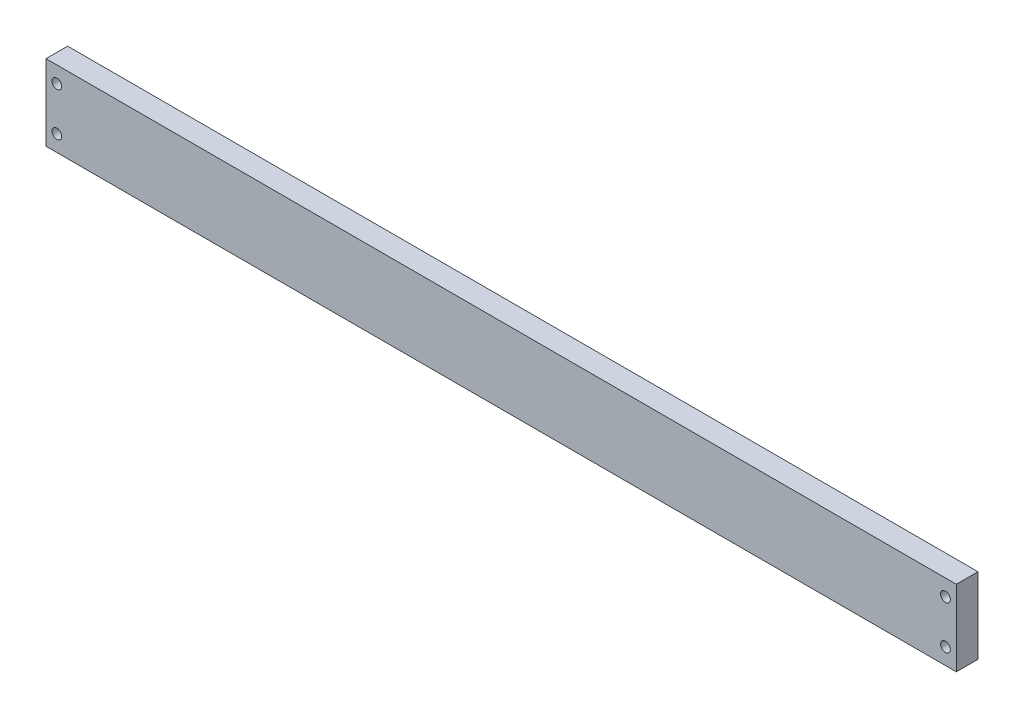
from build123d import *

# Parameters (mm, degrees)
SKETCH_1_W          = 420
SKETCH_1_H          = 35
EXTRUDE_1_DEPTH     = 10
SKETCH_4_R          = 2.25
CUT_EXTRUDE_1_DEPTH = 10


with BuildPart() as part:
    # Sketch 1 → Extrude 1 (new body)
    with BuildSketch(Plane.XY):
        Rectangle(SKETCH_1_W, SKETCH_1_H)
    extrude(amount=EXTRUDE_1_DEPTH)

    # Sketch 4 → Cut-Extrude 1 (cut)
    with BuildSketch(Plane(origin=(0, 0, 0), x_dir=(-1, 0, 0), z_dir=(0, 0, -1))):
        with Locations((-205, 10)):
            Circle(SKETCH_4_R)
        with Locations((-205, -10)):
            Circle(SKETCH_4_R)
        with Locations((205, -10)):
            Circle(SKETCH_4_R)
        with Locations((205, 10)):
            Circle(SKETCH_4_R)
    extrude(amount=-CUT_EXTRUDE_1_DEPTH, mode=Mode.SUBTRACT)


solid = part.part
